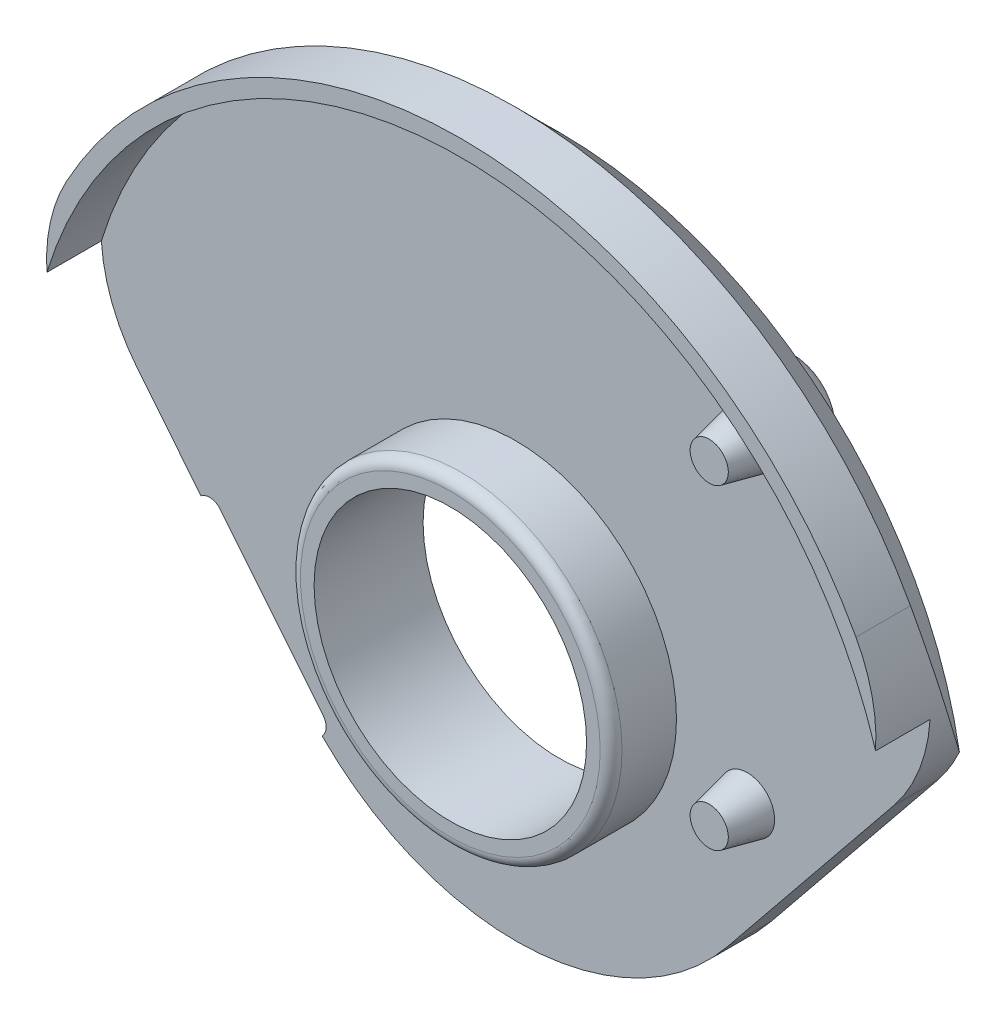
ISO-10303-21;
HEADER;
FILE_DESCRIPTION(('STEP AP214'),'2;1');
FILE_NAME('part.step','',(''),(''),'','','');
FILE_SCHEMA(('AUTOMOTIVE_DESIGN { 1 0 10303 214 1 1 1 1 }'));
ENDSEC;
DATA;
#1=APPLICATION_CONTEXT('core data for automotive mechanical design processes');
#2=APPLICATION_PROTOCOL_DEFINITION('international standard','automotive_design',2000,#1);
#3=PRODUCT_CONTEXT('',#1,'mechanical');
#4=PRODUCT('Part','Part','',(#3));
#5=PRODUCT_RELATED_PRODUCT_CATEGORY('part','',(#4));
#6=PRODUCT_DEFINITION_FORMATION('','',#4);
#7=PRODUCT_DEFINITION_CONTEXT('part definition',#1,'design');
#8=PRODUCT_DEFINITION('design','',#6,#7);
#9=PRODUCT_DEFINITION_SHAPE('','',#8);
#10=(LENGTH_UNIT() NAMED_UNIT(*) SI_UNIT(.MILLI.,.METRE.));
#11=(NAMED_UNIT(*) PLANE_ANGLE_UNIT() SI_UNIT($,.RADIAN.));
#12=(NAMED_UNIT(*) SI_UNIT($,.STERADIAN.) SOLID_ANGLE_UNIT());
#13=UNCERTAINTY_MEASURE_WITH_UNIT(LENGTH_MEASURE(1.E-05),#10,'distance_accuracy_value','');
#14=(GEOMETRIC_REPRESENTATION_CONTEXT(3) GLOBAL_UNCERTAINTY_ASSIGNED_CONTEXT((#13)) GLOBAL_UNIT_ASSIGNED_CONTEXT((#10,
#11,#12)) REPRESENTATION_CONTEXT('',''));
#15=CARTESIAN_POINT('',(0.,0.,0.));
#16=DIRECTION('',(0.,0.,1.));
#17=DIRECTION('',(1.,0.,0.));
#18=AXIS2_PLACEMENT_3D('',#15,#16,#17);
#19=CARTESIAN_POINT('',(3.,4.,-2.2));
#20=DIRECTION('',(0.,0.,1.));
#21=DIRECTION('',(1.,0.,0.));
#22=AXIS2_PLACEMENT_3D('',#19,#20,#21);
#23=PLANE('',#22);
#24=CARTESIAN_POINT('',(3.,4.,-2.2));
#25=DIRECTION('',(0.,0.,-1.));
#26=DIRECTION('',(-1.,0.,0.));
#27=AXIS2_PLACEMENT_3D('',#24,#25,#26);
#28=CIRCLE('',#27,0.460000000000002);
#29=CARTESIAN_POINT('',(2.54,4.,-2.2));
#30=VERTEX_POINT('',#29);
#31=EDGE_CURVE('E21',#30,#30,#28,.F.);
#32=ORIENTED_EDGE('',*,*,#31,.F.);
#33=EDGE_LOOP('',(#32));
#34=FACE_BOUND('',#33,.T.);
#35=ADVANCED_FACE('F17',(#34),#23,.F.);
#36=CARTESIAN_POINT('',(3.,4.,-1.7));
#37=DIRECTION('',(0.,0.,-1.));
#38=DIRECTION('',(-1.,0.,0.));
#39=AXIS2_PLACEMENT_3D('',#36,#37,#38);
#40=DEGENERATE_TOROIDAL_SURFACE('',#39,0.46,0.5,.T.);
#41=ORIENTED_EDGE('',*,*,#31,.T.);
#42=EDGE_LOOP('',(#41));
#43=FACE_BOUND('',#42,.T.);
#44=CARTESIAN_POINT('',(3.,4.,-1.7));
#45=DIRECTION('',(0.,0.,-1.));
#46=DIRECTION('',(-1.,0.,0.));
#47=AXIS2_PLACEMENT_3D('',#44,#45,#46);
#48=CIRCLE('',#47,0.96);
#49=CARTESIAN_POINT('',(2.04,4.,-1.7));
#50=VERTEX_POINT('',#49);
#51=EDGE_CURVE('E120',#50,#50,#48,.F.);
#52=ORIENTED_EDGE('',*,*,#51,.F.);
#53=EDGE_LOOP('',(#52));
#54=FACE_BOUND('',#53,.T.);
#55=ADVANCED_FACE('F19',(#43,#54),#40,.T.);
#56=CARTESIAN_POINT('',(3.,4.,0.));
#57=DIRECTION('',(0.,0.,-1.));
#58=DIRECTION('',(-1.,0.,0.));
#59=AXIS2_PLACEMENT_3D('',#56,#57,#58);
#60=CYLINDRICAL_SURFACE('',#59,0.96);
#61=ORIENTED_EDGE('',*,*,#51,.T.);
#62=EDGE_LOOP('',(#61));
#63=FACE_BOUND('',#62,.T.);
#64=CARTESIAN_POINT('',(3.,4.,-0.8));
#65=DIRECTION('',(0.,0.,-1.));
#66=DIRECTION('',(-1.,0.,0.));
#67=AXIS2_PLACEMENT_3D('',#64,#65,#66);
#68=CIRCLE('',#67,0.96);
#69=CARTESIAN_POINT('',(2.04,4.,-0.8));
#70=VERTEX_POINT('',#69);
#71=EDGE_CURVE('E140',#70,#70,#68,.T.);
#72=ORIENTED_EDGE('',*,*,#71,.T.);
#73=EDGE_LOOP('',(#72));
#74=FACE_BOUND('',#73,.T.);
#75=ADVANCED_FACE('F334',(#63,#74),#60,.T.);
#76=CARTESIAN_POINT('',(0.,0.,0.));
#77=DIRECTION('',(0.,0.,-1.));
#78=DIRECTION('',(-1.,0.,0.));
#79=AXIS2_PLACEMENT_3D('',#76,#77,#78);
#80=CYLINDRICAL_SURFACE('',#79,2.5);
#81=CARTESIAN_POINT('',(0.,0.,-0.8));
#82=DIRECTION('',(0.,0.,-1.));
#83=DIRECTION('',(-1.,0.,0.));
#84=AXIS2_PLACEMENT_3D('',#81,#82,#83);
#85=CIRCLE('',#84,2.5);
#86=CARTESIAN_POINT('',(-2.5,0.,-0.8));
#87=VERTEX_POINT('',#86);
#88=EDGE_CURVE('E143',#87,#87,#85,.T.);
#89=ORIENTED_EDGE('',*,*,#88,.T.);
#90=EDGE_LOOP('',(#89));
#91=FACE_BOUND('',#90,.T.);
#92=CARTESIAN_POINT('',(0.,0.,1.2));
#93=DIRECTION('',(0.,0.,-1.));
#94=DIRECTION('',(-1.,0.,0.));
#95=AXIS2_PLACEMENT_3D('',#92,#93,#94);
#96=CIRCLE('',#95,2.5);
#97=CARTESIAN_POINT('',(-2.5,0.,1.2));
#98=VERTEX_POINT('',#97);
#99=EDGE_CURVE('E133',#98,#98,#96,.F.);
#100=ORIENTED_EDGE('',*,*,#99,.T.);
#101=EDGE_LOOP('',(#100));
#102=FACE_BOUND('',#101,.T.);
#103=ADVANCED_FACE('F331',(#91,#102),#80,.F.);
#104=CARTESIAN_POINT('',(0.,0.,0.));
#105=DIRECTION('',(0.,0.,-1.));
#106=DIRECTION('',(-1.,0.,0.));
#107=AXIS2_PLACEMENT_3D('',#104,#105,#106);
#108=CYLINDRICAL_SURFACE('',#107,8.25);
#109=CARTESIAN_POINT('',(0.,0.,1.));
#110=DIRECTION('',(0.,0.,-1.));
#111=DIRECTION('',(-1.,0.,0.));
#112=AXIS2_PLACEMENT_3D('',#109,#110,#111);
#113=CIRCLE('',#112,8.25);
#114=CARTESIAN_POINT('',(7.24285548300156,3.95013220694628,1.));
#115=VERTEX_POINT('',#114);
#116=CARTESIAN_POINT('',(-7.24285548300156,3.95013220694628,1.));
#117=VERTEX_POINT('',#116);
#118=EDGE_CURVE('E113',#115,#117,#113,.F.);
#119=ORIENTED_EDGE('',*,*,#118,.F.);
#120=DIRECTION('',(0.,0.,-1.));
#121=VECTOR('',#120,1.);
#122=CARTESIAN_POINT('',(7.24285548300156,3.95013220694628,0.));
#123=LINE('',#122,#121);
#124=CARTESIAN_POINT('',(7.24285548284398,3.95013220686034,5.38473404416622E-10));
#125=VERTEX_POINT('',#124);
#126=EDGE_CURVE('E104',#115,#125,#123,.T.);
#127=ORIENTED_EDGE('',*,*,#126,.T.);
#128=CARTESIAN_POINT('',(0.,0.,3.5898367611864E-10));
#129=DIRECTION('',(0.,0.,1.));
#130=DIRECTION('',(0.,1.,0.));
#131=AXIS2_PLACEMENT_3D('',#128,#129,#130);
#132=CIRCLE('',#131,8.24999999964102);
#133=CARTESIAN_POINT('',(-7.24285548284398,3.95013220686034,5.38473404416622E-10));
#134=VERTEX_POINT('',#133);
#135=EDGE_CURVE('E116',#134,#125,#132,.F.);
#136=ORIENTED_EDGE('',*,*,#135,.F.);
#137=DIRECTION('',(0.,0.,-1.));
#138=VECTOR('',#137,1.);
#139=CARTESIAN_POINT('',(-7.24285548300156,3.95013220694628,0.));
#140=LINE('',#139,#138);
#141=EDGE_CURVE('E109',#134,#117,#140,.F.);
#142=ORIENTED_EDGE('',*,*,#141,.T.);
#143=EDGE_LOOP('',(#119,#127,#136,#142));
#144=FACE_BOUND('',#143,.T.);
#145=ADVANCED_FACE('F111',(#144),#108,.T.);
#146=CARTESIAN_POINT('',(0.,0.,1.2));
#147=DIRECTION('',(0.,0.,-1.));
#148=DIRECTION('',(-1.,0.,0.));
#149=AXIS2_PLACEMENT_3D('',#146,#147,#148);
#150=PLANE('',#149);
#151=ORIENTED_EDGE('',*,*,#99,.F.);
#152=EDGE_LOOP('',(#151));
#153=FACE_BOUND('',#152,.T.);
#154=CARTESIAN_POINT('',(0.,0.,1.2));
#155=DIRECTION('',(0.,0.,-1.));
#156=DIRECTION('',(1.,0.,0.));
#157=AXIS2_PLACEMENT_3D('',#154,#155,#156);
#158=CIRCLE('',#157,2.75);
#159=CARTESIAN_POINT('',(2.75,0.,1.2));
#160=VERTEX_POINT('',#159);
#161=EDGE_CURVE('E151',#160,#160,#158,.T.);
#162=ORIENTED_EDGE('',*,*,#161,.F.);
#163=EDGE_LOOP('',(#162));
#164=FACE_BOUND('',#163,.T.);
#165=ADVANCED_FACE('F319',(#153,#164),#150,.F.);
#166=CARTESIAN_POINT('',(0.,5.77962089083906,1.));
#167=DIRECTION('',(0.,0.,1.));
#168=DIRECTION('',(1.,0.,0.));
#169=AXIS2_PLACEMENT_3D('',#166,#167,#168);
#170=PLANE('',#169);
#171=CARTESIAN_POINT('',(0.,0.,1.));
#172=DIRECTION('',(0.,0.,1.));
#173=DIRECTION('',(1.,0.,0.));
#174=AXIS2_PLACEMENT_3D('',#171,#172,#173);
#175=CIRCLE('',#174,7.95);
#176=CARTESIAN_POINT('',(-7.60302402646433,2.32304232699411,1.));
#177=VERTEX_POINT('',#176);
#178=CARTESIAN_POINT('',(7.60302402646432,2.32304232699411,1.));
#179=VERTEX_POINT('',#178);
#180=EDGE_CURVE('E148',#177,#179,#175,.F.);
#181=ORIENTED_EDGE('',*,*,#180,.T.);
#182=CARTESIAN_POINT('',(4.60908985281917,2.51372049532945,1.));
#183=DIRECTION('',(0.,0.,-1.));
#184=DIRECTION('',(-1.,0.,0.));
#185=AXIS2_PLACEMENT_3D('',#182,#183,#184);
#186=CIRCLE('',#185,3.);
#187=EDGE_CURVE('E130',#179,#115,#186,.F.);
#188=ORIENTED_EDGE('',*,*,#187,.T.);
#189=ORIENTED_EDGE('',*,*,#118,.T.);
#190=CARTESIAN_POINT('',(-4.60908985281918,2.51372049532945,1.));
#191=DIRECTION('',(0.,0.,-1.));
#192=DIRECTION('',(-1.,0.,0.));
#193=AXIS2_PLACEMENT_3D('',#190,#191,#192);
#194=CIRCLE('',#193,3.);
#195=EDGE_CURVE('E123',#117,#177,#194,.F.);
#196=ORIENTED_EDGE('',*,*,#195,.T.);
#197=EDGE_LOOP('',(#181,#188,#189,#196));
#198=FACE_BOUND('',#197,.T.);
#199=ADVANCED_FACE('F132',(#198),#170,.T.);
#200=CARTESIAN_POINT('',(0.,5.77962089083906,-0.8));
#201=DIRECTION('',(0.,0.,1.));
#202=DIRECTION('',(1.,0.,0.));
#203=AXIS2_PLACEMENT_3D('',#200,#201,#202);
#204=PLANE('',#203);
#205=ORIENTED_EDGE('',*,*,#88,.F.);
#206=EDGE_LOOP('',(#205));
#207=FACE_BOUND('',#206,.T.);
#208=ORIENTED_EDGE('',*,*,#71,.F.);
#209=EDGE_LOOP('',(#208));
#210=FACE_BOUND('',#209,.T.);
#211=CARTESIAN_POINT('',(4.60908985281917,2.51372049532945,-0.8));
#212=DIRECTION('',(0.,0.,-1.));
#213=DIRECTION('',(-1.,0.,0.));
#214=AXIS2_PLACEMENT_3D('',#211,#212,#213);
#215=CIRCLE('',#214,3.);
#216=CARTESIAN_POINT('',(6.94052773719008,0.625759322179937,-0.8));
#217=VERTEX_POINT('',#216);
#218=CARTESIAN_POINT('',(7.34045278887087,1.27289153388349,-0.800000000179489));
#219=VERTEX_POINT('',#218);
#220=EDGE_CURVE('E138',#217,#219,#215,.F.);
#221=ORIENTED_EDGE('',*,*,#220,.F.);
#222=DIRECTION('',(0.629320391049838,0.77714596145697,0.));
#223=VECTOR('',#222,1.);
#224=CARTESIAN_POINT('',(3.88572980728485,-3.14660195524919,-0.8));
#225=LINE('',#224,#223);
#226=CARTESIAN_POINT('',(3.88572980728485,-3.14660195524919,-0.8));
#227=VERTEX_POINT('',#226);
#228=EDGE_CURVE('E303',#227,#217,#225,.T.);
#229=ORIENTED_EDGE('',*,*,#228,.F.);
#230=CARTESIAN_POINT('',(0.,0.,-0.8));
#231=DIRECTION('',(0.,0.,-1.));
#232=DIRECTION('',(-1.,0.,0.));
#233=AXIS2_PLACEMENT_3D('',#230,#231,#232);
#234=CIRCLE('',#233,5.);
#235=CARTESIAN_POINT('',(-3.55247410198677,-3.51851215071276,-0.8));
#236=VERTEX_POINT('',#235);
#237=EDGE_CURVE('E186',#236,#227,#234,.F.);
#238=ORIENTED_EDGE('',*,*,#237,.F.);
#239=CARTESIAN_POINT('',(-3.7283997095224,-3.34088844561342,-0.8));
#240=DIRECTION('',(0.,0.,-1.));
#241=DIRECTION('',(-1.,0.,0.));
#242=AXIS2_PLACEMENT_3D('',#239,#240,#241);
#243=CIRCLE('',#242,0.250000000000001);
#244=CARTESIAN_POINT('',(-3.53411321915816,-3.18355834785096,-0.8));
#245=VERTEX_POINT('',#244);
#246=EDGE_CURVE('E370',#236,#245,#243,.F.);
#247=ORIENTED_EDGE('',*,*,#246,.T.);
#248=DIRECTION('',(0.629320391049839,-0.77714596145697,0.));
#249=VECTOR('',#248,1.);
#250=CARTESIAN_POINT('',(-5.42280317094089,-0.851220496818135,-0.8));
#251=LINE('',#250,#249);
#252=CARTESIAN_POINT('',(-5.4228031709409,-0.851220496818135,-0.8));
#253=VERTEX_POINT('',#252);
#254=EDGE_CURVE('E307',#253,#245,#251,.T.);
#255=ORIENTED_EDGE('',*,*,#254,.F.);
#256=CARTESIAN_POINT('',(-5.61708966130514,-1.0085505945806,-0.8));
#257=DIRECTION('',(0.,0.,-1.));
#258=DIRECTION('',(-1.,0.,0.));
#259=AXIS2_PLACEMENT_3D('',#256,#257,#258);
#260=CIRCLE('',#259,0.250000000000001);
#261=CARTESIAN_POINT('',(-5.7744197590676,-0.814264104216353,-0.8));
#262=VERTEX_POINT('',#261);
#263=EDGE_CURVE('E310',#253,#262,#260,.F.);
#264=ORIENTED_EDGE('',*,*,#263,.T.);
#265=DIRECTION('',(0.629320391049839,-0.77714596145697,0.));
#266=VECTOR('',#265,1.);
#267=CARTESIAN_POINT('',(-6.94052773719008,0.625759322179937,-0.8));
#268=LINE('',#267,#266);
#269=CARTESIAN_POINT('',(-6.94052773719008,0.625759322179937,-0.8));
#270=VERTEX_POINT('',#269);
#271=EDGE_CURVE('E311',#270,#262,#268,.T.);
#272=ORIENTED_EDGE('',*,*,#271,.F.);
#273=CARTESIAN_POINT('',(-4.60908985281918,2.51372049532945,-0.8));
#274=DIRECTION('',(0.,0.,-1.));
#275=DIRECTION('',(-1.,0.,0.));
#276=AXIS2_PLACEMENT_3D('',#273,#274,#275);
#277=CIRCLE('',#276,3.);
#278=CARTESIAN_POINT('',(-7.34045278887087,1.27289153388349,-0.800000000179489));
#279=VERTEX_POINT('',#278);
#280=EDGE_CURVE('E158',#279,#270,#277,.F.);
#281=ORIENTED_EDGE('',*,*,#280,.F.);
#282=CARTESIAN_POINT('',(0.,0.,-0.800000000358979));
#283=DIRECTION('',(0.,0.,1.));
#284=DIRECTION('',(1.,0.,0.));
#285=AXIS2_PLACEMENT_3D('',#282,#283,#284);
#286=CIRCLE('',#285,7.45000000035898);
#287=EDGE_CURVE('E146',#219,#279,#286,.T.);
#288=ORIENTED_EDGE('',*,*,#287,.F.);
#289=EDGE_LOOP('',(#221,#229,#238,#247,#255,#264,#272,#281,#288));
#290=FACE_BOUND('',#289,.T.);
#291=ADVANCED_FACE('F169',(#207,#210,#290),#204,.F.);
#292=CARTESIAN_POINT('',(0.,0.,3.58982971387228E-10));
#293=DIRECTION('',(0.,0.,1.));
#294=DIRECTION('',(1.,0.,0.));
#295=AXIS2_PLACEMENT_3D('',#292,#293,#294);
#296=CONICAL_SURFACE('',#295,8.24999999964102,0.7853981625);
#297=CARTESIAN_POINT('',(-7.24285548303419,3.95013220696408,7.02565920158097E-10));
#298=CARTESIAN_POINT('',(-7.27853072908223,3.88474691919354,6.14051450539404E-06));
#299=CARTESIAN_POINT('',(-7.31174406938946,3.81802712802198,-0.00176509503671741));
#300=CARTESIAN_POINT('',(-7.37305561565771,3.68248200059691,-0.00881469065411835));
#301=CARTESIAN_POINT('',(-7.40115548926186,3.61365735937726,-0.014091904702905));
#302=CARTESIAN_POINT('',(-7.45195727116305,3.47473718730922,-0.0280742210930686));
#303=CARTESIAN_POINT('',(-7.47468300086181,3.40464880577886,-0.0367637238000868));
#304=CARTESIAN_POINT('',(-7.51482072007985,3.26346860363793,-0.0574747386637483));
#305=CARTESIAN_POINT('',(-7.53223249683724,3.19237674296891,-0.069496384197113));
#306=CARTESIAN_POINT('',(-7.57642183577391,2.9785361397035,-0.110375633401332));
#307=CARTESIAN_POINT('',(-7.59524489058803,2.83496923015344,-0.144073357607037));
#308=CARTESIAN_POINT('',(-7.61228210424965,2.54984997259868,-0.223191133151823));
#309=CARTESIAN_POINT('',(-7.61047339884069,2.40830003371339,-0.26862413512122));
#310=CARTESIAN_POINT('',(-7.58721001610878,2.12357645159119,-0.372389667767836));
#311=CARTESIAN_POINT('',(-7.56476969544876,1.98068058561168,-0.431256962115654));
#312=CARTESIAN_POINT('',(-7.50120597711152,1.70389692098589,-0.558754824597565));
#313=CARTESIAN_POINT('',(-7.46009771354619,1.57000192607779,-0.627377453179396));
#314=CARTESIAN_POINT('',(-7.38903083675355,1.38424196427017,-0.732608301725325));
#315=CARTESIAN_POINT('',(-7.36548218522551,1.3279692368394,-0.765929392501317));
#316=CARTESIAN_POINT('',(-7.34045278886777,1.27289153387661,-0.800000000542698));
#317=B_SPLINE_CURVE_WITH_KNOTS('',3,(#297,#298,#299,#300,#301,#302,#303,#304,#305,#306,#307,
#308,#309,#310,#311,#312,#313,#314,#315,#316),.UNSPECIFIED.,.F.,.F.,(4,2,2,2,2,2,2,2,2,4),(0.,
0.223368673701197,0.446664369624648,0.66895091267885,0.891246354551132,1.3350364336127,
1.77931837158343,2.24599396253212,2.71229189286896,2.92066672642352),.UNSPECIFIED.);
#318=EDGE_CURVE('E150',#134,#279,#317,.T.);
#319=ORIENTED_EDGE('',*,*,#318,.F.);
#320=ORIENTED_EDGE('',*,*,#135,.T.);
#321=CARTESIAN_POINT('',(7.34045278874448,1.27289153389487,-0.800000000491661));
#322=CARTESIAN_POINT('',(7.37202516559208,1.3423767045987,-0.75702049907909));
#323=CARTESIAN_POINT('',(7.40122962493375,1.41371842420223,-0.71525446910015));
#324=CARTESIAN_POINT('',(7.4544624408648,1.55983494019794,-0.63437898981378));
#325=CARTESIAN_POINT('',(7.47848677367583,1.63461235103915,-0.59527162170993));
#326=CARTESIAN_POINT('',(7.52100528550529,1.78770317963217,-0.519768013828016));
#327=CARTESIAN_POINT('',(7.5394628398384,1.86603627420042,-0.483390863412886));
#328=CARTESIAN_POINT('',(7.57017857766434,2.0253242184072,-0.413918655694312));
#329=CARTESIAN_POINT('',(7.58243763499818,2.10627869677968,-0.380823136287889));
#330=CARTESIAN_POINT('',(7.60038753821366,2.27077419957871,-0.318013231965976));
#331=CARTESIAN_POINT('',(7.60603870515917,2.35432778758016,-0.288320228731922));
#332=CARTESIAN_POINT('',(7.610259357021,2.52285947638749,-0.232859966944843));
#333=CARTESIAN_POINT('',(7.60883284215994,2.60783674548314,-0.20709049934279));
#334=CARTESIAN_POINT('',(7.59862274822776,2.77817717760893,-0.15984248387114));
#335=CARTESIAN_POINT('',(7.58986950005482,2.86353730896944,-0.138346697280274));
#336=CARTESIAN_POINT('',(7.56486790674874,3.03412357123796,-0.099781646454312));
#337=CARTESIAN_POINT('',(7.54862091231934,3.11934972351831,-0.0827115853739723));
#338=CARTESIAN_POINT('',(7.49820509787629,3.33246650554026,-0.0456358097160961));
#339=CARTESIAN_POINT('',(7.45911737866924,3.45978960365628,-0.0286247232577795));
#340=CARTESIAN_POINT('',(7.3876576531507,3.64689341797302,-0.0115034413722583));
#341=CARTESIAN_POINT('',(7.36159653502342,3.7088045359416,-0.00719539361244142));
#342=CARTESIAN_POINT('',(7.30531354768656,3.83087395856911,-0.00144313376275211));
#343=CARTESIAN_POINT('',(7.27508994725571,3.8910315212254,-1.17140153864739E-07));
#344=CARTESIAN_POINT('',(7.24285548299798,3.95013220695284,7.17960576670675E-10));
#345=B_SPLINE_CURVE_WITH_KNOTS('',3,(#321,#322,#323,#324,#325,#326,#327,#328,#329,#330,#331,
#332,#333,#334,#335,#336,#337,#338,#339,#340,#341,#342,#343,#344),.UNSPECIFIED.,.F.,.F.,(4,2,2,
2,2,2,2,2,2,2,2,4),(0.,0.262749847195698,0.525703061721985,0.790350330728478,1.05496028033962,
1.32115112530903,1.58719153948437,1.8521360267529,2.11703277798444,2.5179724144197,
2.71972517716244,2.92156210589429),.UNSPECIFIED.);
#346=EDGE_CURVE('E175',#219,#125,#345,.T.);
#347=ORIENTED_EDGE('',*,*,#346,.F.);
#348=ORIENTED_EDGE('',*,*,#287,.T.);
#349=EDGE_LOOP('',(#319,#320,#347,#348));
#350=FACE_BOUND('',#349,.T.);
#351=ADVANCED_FACE('F163',(#350),#296,.T.);
#352=CARTESIAN_POINT('',(4.25,5.1,0.7));
#353=DIRECTION('',(0.,0.,-1.));
#354=DIRECTION('',(-1.,0.,0.));
#355=AXIS2_PLACEMENT_3D('',#352,#353,#354);
#356=PLANE('',#355);
#357=CARTESIAN_POINT('',(4.25,5.1,0.70000000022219));
#358=DIRECTION('',(0.,0.,-1.));
#359=DIRECTION('',(-1.,0.,0.));
#360=AXIS2_PLACEMENT_3D('',#357,#358,#359);
#361=CIRCLE('',#360,0.350060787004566);
#362=CARTESIAN_POINT('',(3.89993921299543,5.1,0.70000000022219));
#363=VERTEX_POINT('',#362);
#364=EDGE_CURVE('E184',#363,#363,#361,.T.);
#365=ORIENTED_EDGE('',*,*,#364,.F.);
#366=EDGE_LOOP('',(#365));
#367=FACE_BOUND('',#366,.T.);
#368=ADVANCED_FACE('F168',(#367),#356,.F.);
#369=CARTESIAN_POINT('',(4.25,-0.7,0.7));
#370=DIRECTION('',(0.,0.,-1.));
#371=DIRECTION('',(-1.,0.,0.));
#372=AXIS2_PLACEMENT_3D('',#369,#370,#371);
#373=PLANE('',#372);
#374=CARTESIAN_POINT('',(4.25,-0.7,0.70000000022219));
#375=DIRECTION('',(0.,0.,-1.));
#376=DIRECTION('',(-1.,0.,0.));
#377=AXIS2_PLACEMENT_3D('',#374,#375,#376);
#378=CIRCLE('',#377,0.350060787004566);
#379=CARTESIAN_POINT('',(3.89993921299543,-0.7,0.70000000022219));
#380=VERTEX_POINT('',#379);
#381=EDGE_CURVE('E245',#380,#380,#378,.T.);
#382=ORIENTED_EDGE('',*,*,#381,.F.);
#383=EDGE_LOOP('',(#382));
#384=FACE_BOUND('',#383,.T.);
#385=ADVANCED_FACE('F297',(#384),#373,.F.);
#386=CARTESIAN_POINT('',(0.,0.,1.));
#387=DIRECTION('',(0.,0.,-1.));
#388=DIRECTION('',(-1.,0.,0.));
#389=AXIS2_PLACEMENT_3D('',#386,#387,#388);
#390=TOROIDAL_SURFACE('',#389,2.75,0.2);
#391=CARTESIAN_POINT('',(0.,0.,1.));
#392=DIRECTION('',(0.,0.,1.));
#393=DIRECTION('',(1.,0.,0.));
#394=AXIS2_PLACEMENT_3D('',#391,#392,#393);
#395=CIRCLE('',#394,2.95);
#396=CARTESIAN_POINT('',(2.95,0.,1.));
#397=VERTEX_POINT('',#396);
#398=EDGE_CURVE('E247',#397,#397,#395,.F.);
#399=ORIENTED_EDGE('',*,*,#398,.F.);
#400=EDGE_LOOP('',(#399));
#401=FACE_BOUND('',#400,.T.);
#402=ORIENTED_EDGE('',*,*,#161,.T.);
#403=EDGE_LOOP('',(#402));
#404=FACE_BOUND('',#403,.T.);
#405=ADVANCED_FACE('F288',(#401,#404),#390,.T.);
#406=CARTESIAN_POINT('',(0.,0.,0.));
#407=DIRECTION('',(0.,0.,1.));
#408=DIRECTION('',(1.,0.,0.));
#409=AXIS2_PLACEMENT_3D('',#406,#407,#408);
#410=CYLINDRICAL_SURFACE('',#409,7.95);
#411=DIRECTION('',(0.,0.,-1.));
#412=VECTOR('',#411,1.);
#413=CARTESIAN_POINT('',(-7.60302402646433,2.32304232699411,0.));
#414=LINE('',#413,#412);
#415=CARTESIAN_POINT('',(-7.60302402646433,2.32304232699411,0.));
#416=VERTEX_POINT('',#415);
#417=EDGE_CURVE('E126',#416,#177,#414,.F.);
#418=ORIENTED_EDGE('',*,*,#417,.F.);
#419=CARTESIAN_POINT('',(0.,0.,0.));
#420=DIRECTION('',(0.,0.,1.));
#421=DIRECTION('',(1.,0.,0.));
#422=AXIS2_PLACEMENT_3D('',#419,#420,#421);
#423=CIRCLE('',#422,7.95);
#424=CARTESIAN_POINT('',(7.60302402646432,2.32304232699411,0.));
#425=VERTEX_POINT('',#424);
#426=EDGE_CURVE('E249',#425,#416,#423,.T.);
#427=ORIENTED_EDGE('',*,*,#426,.F.);
#428=DIRECTION('',(0.,0.,-1.));
#429=VECTOR('',#428,1.);
#430=CARTESIAN_POINT('',(7.60302402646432,2.32304232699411,0.));
#431=LINE('',#430,#429);
#432=EDGE_CURVE('E182',#179,#425,#431,.T.);
#433=ORIENTED_EDGE('',*,*,#432,.F.);
#434=ORIENTED_EDGE('',*,*,#180,.F.);
#435=EDGE_LOOP('',(#418,#427,#433,#434));
#436=FACE_BOUND('',#435,.T.);
#437=ADVANCED_FACE('F220',(#436),#410,.F.);
#438=CARTESIAN_POINT('',(-4.60908985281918,2.51372049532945,0.));
#439=DIRECTION('',(0.,0.,-1.));
#440=DIRECTION('',(-1.,0.,0.));
#441=AXIS2_PLACEMENT_3D('',#438,#439,#440);
#442=CYLINDRICAL_SURFACE('',#441,3.);
#443=ORIENTED_EDGE('',*,*,#195,.F.);
#444=ORIENTED_EDGE('',*,*,#141,.F.);
#445=ORIENTED_EDGE('',*,*,#318,.T.);
#446=ORIENTED_EDGE('',*,*,#280,.T.);
#447=DIRECTION('',(0.,0.,1.));
#448=VECTOR('',#447,1.);
#449=CARTESIAN_POINT('',(-6.94052773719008,0.625759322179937,0.));
#450=LINE('',#449,#448);
#451=CARTESIAN_POINT('',(-6.94052773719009,0.625759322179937,0.));
#452=VERTEX_POINT('',#451);
#453=EDGE_CURVE('E313',#452,#270,#450,.F.);
#454=ORIENTED_EDGE('',*,*,#453,.F.);
#455=CARTESIAN_POINT('',(-4.60908985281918,2.51372049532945,0.));
#456=DIRECTION('',(0.,0.,-1.));
#457=DIRECTION('',(-1.,0.,0.));
#458=AXIS2_PLACEMENT_3D('',#455,#456,#457);
#459=CIRCLE('',#458,3.);
#460=EDGE_CURVE('E255',#416,#452,#459,.F.);
#461=ORIENTED_EDGE('',*,*,#460,.F.);
#462=ORIENTED_EDGE('',*,*,#417,.T.);
#463=EDGE_LOOP('',(#443,#444,#445,#446,#454,#461,#462));
#464=FACE_BOUND('',#463,.T.);
#465=ADVANCED_FACE('F124',(#464),#442,.T.);
#466=CARTESIAN_POINT('',(-6.94052773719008,0.625759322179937,0.));
#467=DIRECTION('',(-0.77714596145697,-0.629320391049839,0.));
#468=DIRECTION('',(0.629320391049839,-0.77714596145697,0.));
#469=AXIS2_PLACEMENT_3D('',#466,#467,#468);
#470=PLANE('',#469);
#471=DIRECTION('',(0.629320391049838,-0.77714596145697,0.));
#472=VECTOR('',#471,1.);
#473=CARTESIAN_POINT('',(-6.94052773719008,0.625759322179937,0.));
#474=LINE('',#473,#472);
#475=CARTESIAN_POINT('',(-5.7744197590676,-0.814264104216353,0.));
#476=VERTEX_POINT('',#475);
#477=EDGE_CURVE('E258',#452,#476,#474,.T.);
#478=ORIENTED_EDGE('',*,*,#477,.F.);
#479=ORIENTED_EDGE('',*,*,#453,.T.);
#480=ORIENTED_EDGE('',*,*,#271,.T.);
#481=DIRECTION('',(0.,0.,-1.));
#482=VECTOR('',#481,1.);
#483=CARTESIAN_POINT('',(-5.7744197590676,-0.814264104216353,0.));
#484=LINE('',#483,#482);
#485=EDGE_CURVE('E373',#262,#476,#484,.F.);
#486=ORIENTED_EDGE('',*,*,#485,.T.);
#487=EDGE_LOOP('',(#478,#479,#480,#486));
#488=FACE_BOUND('',#487,.T.);
#489=ADVANCED_FACE('F212',(#488),#470,.T.);
#490=CARTESIAN_POINT('',(-5.61708966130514,-1.0085505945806,0.));
#491=DIRECTION('',(0.,0.,-1.));
#492=DIRECTION('',(-1.,0.,0.));
#493=AXIS2_PLACEMENT_3D('',#490,#491,#492);
#494=CYLINDRICAL_SURFACE('',#493,0.250000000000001);
#495=DIRECTION('',(0.,0.,1.));
#496=VECTOR('',#495,1.);
#497=CARTESIAN_POINT('',(-5.42280317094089,-0.851220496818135,0.));
#498=LINE('',#497,#496);
#499=CARTESIAN_POINT('',(-5.42280317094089,-0.851220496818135,0.));
#500=VERTEX_POINT('',#499);
#501=EDGE_CURVE('E309',#500,#253,#498,.F.);
#502=ORIENTED_EDGE('',*,*,#501,.F.);
#503=CARTESIAN_POINT('',(-5.61708966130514,-1.0085505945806,0.));
#504=DIRECTION('',(0.,0.,-1.));
#505=DIRECTION('',(-1.,0.,0.));
#506=AXIS2_PLACEMENT_3D('',#503,#504,#505);
#507=CIRCLE('',#506,0.250000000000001);
#508=EDGE_CURVE('E259',#476,#500,#507,.T.);
#509=ORIENTED_EDGE('',*,*,#508,.F.);
#510=ORIENTED_EDGE('',*,*,#485,.F.);
#511=ORIENTED_EDGE('',*,*,#263,.F.);
#512=EDGE_LOOP('',(#502,#509,#510,#511));
#513=FACE_BOUND('',#512,.T.);
#514=ADVANCED_FACE('F209',(#513),#494,.F.);
#515=CARTESIAN_POINT('',(-5.42280317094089,-0.851220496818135,0.));
#516=DIRECTION('',(-0.77714596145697,-0.629320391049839,0.));
#517=DIRECTION('',(0.629320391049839,-0.77714596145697,0.));
#518=AXIS2_PLACEMENT_3D('',#515,#516,#517);
#519=PLANE('',#518);
#520=DIRECTION('',(0.629320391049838,-0.77714596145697,0.));
#521=VECTOR('',#520,1.);
#522=CARTESIAN_POINT('',(-5.42280317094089,-0.851220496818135,0.));
#523=LINE('',#522,#521);
#524=CARTESIAN_POINT('',(-3.53411321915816,-3.18355834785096,0.));
#525=VERTEX_POINT('',#524);
#526=EDGE_CURVE('E262',#500,#525,#523,.T.);
#527=ORIENTED_EDGE('',*,*,#526,.F.);
#528=ORIENTED_EDGE('',*,*,#501,.T.);
#529=ORIENTED_EDGE('',*,*,#254,.T.);
#530=DIRECTION('',(0.,0.,-1.));
#531=VECTOR('',#530,1.);
#532=CARTESIAN_POINT('',(-3.53411321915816,-3.18355834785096,0.));
#533=LINE('',#532,#531);
#534=EDGE_CURVE('E368',#245,#525,#533,.F.);
#535=ORIENTED_EDGE('',*,*,#534,.T.);
#536=EDGE_LOOP('',(#527,#528,#529,#535));
#537=FACE_BOUND('',#536,.T.);
#538=ADVANCED_FACE('F205',(#537),#519,.T.);
#539=CARTESIAN_POINT('',(-3.7283997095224,-3.34088844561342,0.));
#540=DIRECTION('',(0.,0.,-1.));
#541=DIRECTION('',(-1.,0.,0.));
#542=AXIS2_PLACEMENT_3D('',#539,#540,#541);
#543=CYLINDRICAL_SURFACE('',#542,0.250000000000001);
#544=DIRECTION('',(0.,0.,-1.));
#545=VECTOR('',#544,1.);
#546=CARTESIAN_POINT('',(-3.55247410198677,-3.51851215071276,0.));
#547=LINE('',#546,#545);
#548=CARTESIAN_POINT('',(-3.55247410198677,-3.51851215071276,0.));
#549=VERTEX_POINT('',#548);
#550=EDGE_CURVE('E305',#549,#236,#547,.T.);
#551=ORIENTED_EDGE('',*,*,#550,.F.);
#552=CARTESIAN_POINT('',(-3.7283997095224,-3.34088844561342,0.));
#553=DIRECTION('',(0.,0.,-1.));
#554=DIRECTION('',(-1.,0.,0.));
#555=AXIS2_PLACEMENT_3D('',#552,#553,#554);
#556=CIRCLE('',#555,0.250000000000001);
#557=EDGE_CURVE('E263',#525,#549,#556,.T.);
#558=ORIENTED_EDGE('',*,*,#557,.F.);
#559=ORIENTED_EDGE('',*,*,#534,.F.);
#560=ORIENTED_EDGE('',*,*,#246,.F.);
#561=EDGE_LOOP('',(#551,#558,#559,#560));
#562=FACE_BOUND('',#561,.T.);
#563=ADVANCED_FACE('F201',(#562),#543,.F.);
#564=CARTESIAN_POINT('',(0.,0.,0.));
#565=DIRECTION('',(0.,0.,-1.));
#566=DIRECTION('',(-1.,0.,0.));
#567=AXIS2_PLACEMENT_3D('',#564,#565,#566);
#568=CYLINDRICAL_SURFACE('',#567,5.);
#569=CARTESIAN_POINT('',(0.,0.,0.));
#570=DIRECTION('',(0.,0.,-1.));
#571=DIRECTION('',(-1.,0.,0.));
#572=AXIS2_PLACEMENT_3D('',#569,#570,#571);
#573=CIRCLE('',#572,5.);
#574=CARTESIAN_POINT('',(3.88572980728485,-3.14660195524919,0.));
#575=VERTEX_POINT('',#574);
#576=EDGE_CURVE('E266',#549,#575,#573,.F.);
#577=ORIENTED_EDGE('',*,*,#576,.F.);
#578=ORIENTED_EDGE('',*,*,#550,.T.);
#579=ORIENTED_EDGE('',*,*,#237,.T.);
#580=DIRECTION('',(0.,0.,1.));
#581=VECTOR('',#580,1.);
#582=CARTESIAN_POINT('',(3.88572980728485,-3.14660195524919,0.));
#583=LINE('',#582,#581);
#584=EDGE_CURVE('E183',#575,#227,#583,.F.);
#585=ORIENTED_EDGE('',*,*,#584,.F.);
#586=EDGE_LOOP('',(#577,#578,#579,#585));
#587=FACE_BOUND('',#586,.T.);
#588=ADVANCED_FACE('F198',(#587),#568,.T.);
#589=CARTESIAN_POINT('',(3.88572980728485,-3.14660195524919,0.));
#590=DIRECTION('',(0.77714596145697,-0.629320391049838,0.));
#591=DIRECTION('',(0.629320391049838,0.77714596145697,0.));
#592=AXIS2_PLACEMENT_3D('',#589,#590,#591);
#593=PLANE('',#592);
#594=DIRECTION('',(0.629320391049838,0.77714596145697,0.));
#595=VECTOR('',#594,1.);
#596=CARTESIAN_POINT('',(3.88572980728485,-3.14660195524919,0.));
#597=LINE('',#596,#595);
#598=CARTESIAN_POINT('',(6.94052773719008,0.625759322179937,0.));
#599=VERTEX_POINT('',#598);
#600=EDGE_CURVE('E269',#575,#599,#597,.T.);
#601=ORIENTED_EDGE('',*,*,#600,.F.);
#602=ORIENTED_EDGE('',*,*,#584,.T.);
#603=ORIENTED_EDGE('',*,*,#228,.T.);
#604=DIRECTION('',(0.,0.,-1.));
#605=VECTOR('',#604,1.);
#606=CARTESIAN_POINT('',(6.94052773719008,0.625759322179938,0.));
#607=LINE('',#606,#605);
#608=EDGE_CURVE('E36',#599,#217,#607,.T.);
#609=ORIENTED_EDGE('',*,*,#608,.F.);
#610=EDGE_LOOP('',(#601,#602,#603,#609));
#611=FACE_BOUND('',#610,.T.);
#612=ADVANCED_FACE('F194',(#611),#593,.T.);
#613=CARTESIAN_POINT('',(4.60908985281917,2.51372049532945,0.));
#614=DIRECTION('',(0.,0.,-1.));
#615=DIRECTION('',(-1.,0.,0.));
#616=AXIS2_PLACEMENT_3D('',#613,#614,#615);
#617=CYLINDRICAL_SURFACE('',#616,3.);
#618=ORIENTED_EDGE('',*,*,#608,.T.);
#619=ORIENTED_EDGE('',*,*,#220,.T.);
#620=ORIENTED_EDGE('',*,*,#346,.T.);
#621=ORIENTED_EDGE('',*,*,#126,.F.);
#622=ORIENTED_EDGE('',*,*,#187,.F.);
#623=ORIENTED_EDGE('',*,*,#432,.T.);
#624=CARTESIAN_POINT('',(4.60908985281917,2.51372049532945,0.));
#625=DIRECTION('',(0.,0.,-1.));
#626=DIRECTION('',(-1.,0.,0.));
#627=AXIS2_PLACEMENT_3D('',#624,#625,#626);
#628=CIRCLE('',#627,3.);
#629=EDGE_CURVE('E270',#599,#425,#628,.F.);
#630=ORIENTED_EDGE('',*,*,#629,.F.);
#631=EDGE_LOOP('',(#618,#619,#620,#621,#622,#623,#630));
#632=FACE_BOUND('',#631,.T.);
#633=ADVANCED_FACE('F188',(#632),#617,.T.);
#634=CARTESIAN_POINT('',(4.25,5.1,2.8421709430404E-10));
#635=DIRECTION('',(0.,0.,-1.));
#636=DIRECTION('',(-1.,0.,0.));
#637=AXIS2_PLACEMENT_3D('',#634,#635,#636);
#638=CONICAL_SURFACE('',#637,0.500000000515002,0.211010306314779);
#639=CARTESIAN_POINT('',(4.25,5.1,1.13686837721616E-10));
#640=DIRECTION('',(0.,0.,-1.));
#641=DIRECTION('',(-1.,0.,0.));
#642=AXIS2_PLACEMENT_3D('',#639,#640,#641);
#643=CIRCLE('',#642,0.500000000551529);
#644=CARTESIAN_POINT('',(3.74999999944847,5.1,1.13686837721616E-10));
#645=VERTEX_POINT('',#644);
#646=EDGE_CURVE('E273',#645,#645,#643,.T.);
#647=ORIENTED_EDGE('',*,*,#646,.F.);
#648=EDGE_LOOP('',(#647));
#649=FACE_BOUND('',#648,.T.);
#650=ORIENTED_EDGE('',*,*,#364,.T.);
#651=EDGE_LOOP('',(#650));
#652=FACE_BOUND('',#651,.T.);
#653=ADVANCED_FACE('F193',(#649,#652),#638,.T.);
#654=CARTESIAN_POINT('',(4.25,-0.7,2.8421709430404E-10));
#655=DIRECTION('',(0.,0.,-1.));
#656=DIRECTION('',(-1.,0.,0.));
#657=AXIS2_PLACEMENT_3D('',#654,#655,#656);
#658=CONICAL_SURFACE('',#657,0.500000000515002,0.211010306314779);
#659=CARTESIAN_POINT('',(4.25,-0.7,1.13686837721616E-10));
#660=DIRECTION('',(0.,0.,-1.));
#661=DIRECTION('',(-1.,0.,0.));
#662=AXIS2_PLACEMENT_3D('',#659,#660,#661);
#663=CIRCLE('',#662,0.500000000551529);
#664=CARTESIAN_POINT('',(3.74999999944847,-0.7,1.13686837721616E-10));
#665=VERTEX_POINT('',#664);
#666=EDGE_CURVE('E27',#665,#665,#663,.T.);
#667=ORIENTED_EDGE('',*,*,#666,.F.);
#668=EDGE_LOOP('',(#667));
#669=FACE_BOUND('',#668,.T.);
#670=ORIENTED_EDGE('',*,*,#381,.T.);
#671=EDGE_LOOP('',(#670));
#672=FACE_BOUND('',#671,.T.);
#673=ADVANCED_FACE('F230',(#669,#672),#658,.T.);
#674=CARTESIAN_POINT('',(0.,0.,0.));
#675=DIRECTION('',(0.,0.,1.));
#676=DIRECTION('',(1.,0.,0.));
#677=AXIS2_PLACEMENT_3D('',#674,#675,#676);
#678=CYLINDRICAL_SURFACE('',#677,2.95);
#679=ORIENTED_EDGE('',*,*,#398,.T.);
#680=EDGE_LOOP('',(#679));
#681=FACE_BOUND('',#680,.T.);
#682=CARTESIAN_POINT('',(0.,0.,0.));
#683=DIRECTION('',(0.,0.,1.));
#684=DIRECTION('',(1.,0.,0.));
#685=AXIS2_PLACEMENT_3D('',#682,#683,#684);
#686=CIRCLE('',#685,2.95);
#687=CARTESIAN_POINT('',(2.95,0.,0.));
#688=VERTEX_POINT('',#687);
#689=EDGE_CURVE('E11',#688,#688,#686,.F.);
#690=ORIENTED_EDGE('',*,*,#689,.F.);
#691=EDGE_LOOP('',(#690));
#692=FACE_BOUND('',#691,.T.);
#693=ADVANCED_FACE('F224',(#681,#692),#678,.T.);
#694=CARTESIAN_POINT('',(0.,5.77962089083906,0.));
#695=DIRECTION('',(0.,0.,1.));
#696=DIRECTION('',(1.,0.,0.));
#697=AXIS2_PLACEMENT_3D('',#694,#695,#696);
#698=PLANE('',#697);
#699=ORIENTED_EDGE('',*,*,#689,.T.);
#700=EDGE_LOOP('',(#699));
#701=FACE_BOUND('',#700,.T.);
#702=ORIENTED_EDGE('',*,*,#666,.T.);
#703=EDGE_LOOP('',(#702));
#704=FACE_BOUND('',#703,.T.);
#705=ORIENTED_EDGE('',*,*,#646,.T.);
#706=EDGE_LOOP('',(#705));
#707=FACE_BOUND('',#706,.T.);
#708=ORIENTED_EDGE('',*,*,#600,.T.);
#709=ORIENTED_EDGE('',*,*,#629,.T.);
#710=ORIENTED_EDGE('',*,*,#426,.T.);
#711=ORIENTED_EDGE('',*,*,#460,.T.);
#712=ORIENTED_EDGE('',*,*,#477,.T.);
#713=ORIENTED_EDGE('',*,*,#508,.T.);
#714=ORIENTED_EDGE('',*,*,#526,.T.);
#715=ORIENTED_EDGE('',*,*,#557,.T.);
#716=ORIENTED_EDGE('',*,*,#576,.T.);
#717=EDGE_LOOP('',(#708,#709,#710,#711,#712,#713,#714,#715,#716));
#718=FACE_BOUND('',#717,.T.);
#719=ADVANCED_FACE('F222',(#701,#704,#707,#718),#698,.T.);
#720=CLOSED_SHELL('',(#35,#55,#75,#103,#145,#165,#199,#291,#351,#368,#385,#405,#437,#465,#489,
#514,#538,#563,#588,#612,#633,#653,#673,#693,#719));
#721=MANIFOLD_SOLID_BREP('B1',#720);
#722=ADVANCED_BREP_SHAPE_REPRESENTATION('',(#18,#721),#14);
#723=SHAPE_DEFINITION_REPRESENTATION(#9,#722);
ENDSEC;
END-ISO-10303-21;
